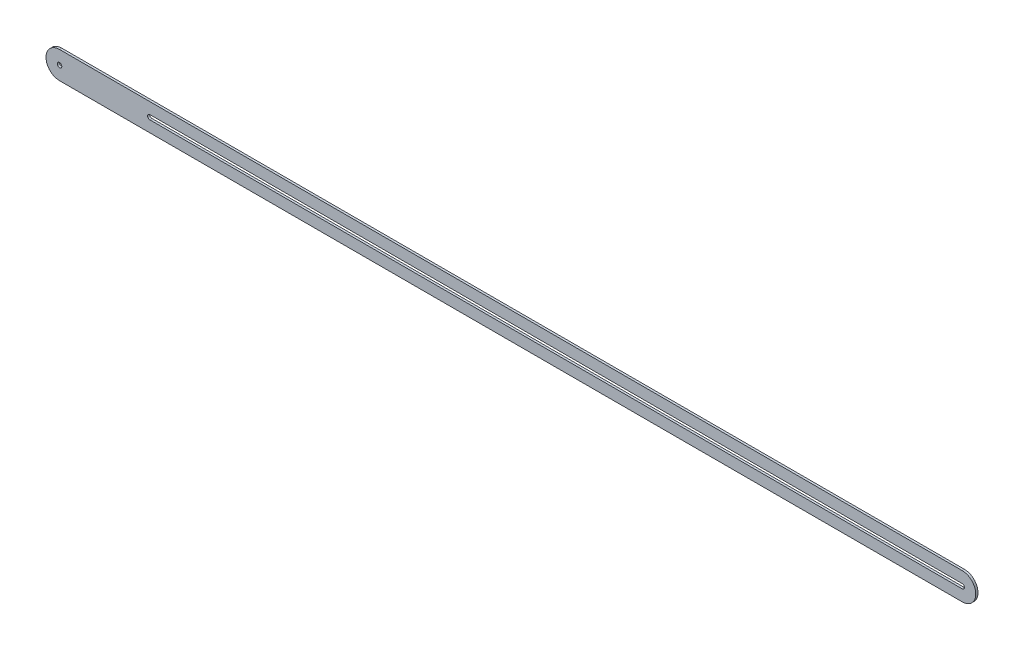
from build123d import *

# Parameters (mm, degrees)
SKETCH1_R           = 1
BOSS_EXTRUDE1_DEPTH = 1


with BuildPart() as part:
    # Sketch1 → Boss-Extrude1 (new body)
    with BuildSketch(Plane.XY):
        with BuildLine():
            Line((0, 6), (400, 6))
            ThreePointArc((400, 6), (406, 0), (400, -6))
            Line((400, -6), (0, -6))
            ThreePointArc((0, -6), (-6, 0), (0, 6))
        make_face()
        Circle(SKETCH1_R, mode=Mode.SUBTRACT)
        with BuildLine():
            Line((40, 1), (400, 1))
            ThreePointArc((400, 1), (401, 0), (400, -1))
            Line((400, -1), (40, -1))
            ThreePointArc((40, -1), (39, 0), (40, 1))
        make_face(mode=Mode.SUBTRACT)
    extrude(amount=BOSS_EXTRUDE1_DEPTH)


solid = part.part
